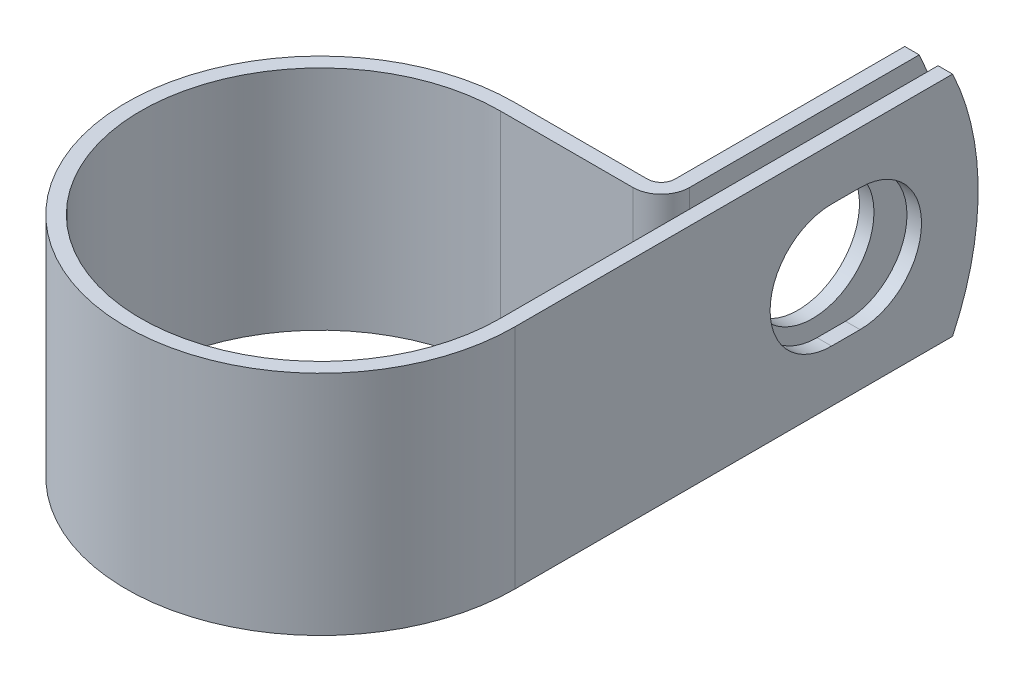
from build123d import *

# Parameters (mm, degrees)
EXTRUDE_THIN1_DEPTH = 9.525
SKETCH2_R           = 5.1562
CUT_EXTRUDE1_DEPTH  = 1.2192
CUT_EXTRUDE2_REACH  = 53.604
CUT_EXTRUDE3_DEPTH  = 50.168193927


with BuildPart() as part:
    # Sketch1 → Extrude-Thin1 (new, symmetric)
    with BuildSketch(Plane(origin=(0, 0, 0), x_dir=(1, 0, 0), z_dir=(0, 1, 0))):
        with BuildLine():
            Line((15.0749, 38.862), (15.0749, 15.0749))
            Line((15.0749, 15.0749), (15.0749, 0))
            ThreePointArc((15.0749, 0), (-10.659564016, -10.659564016), (0, 15.0749))
            Line((0, 15.0749), (11.12266, 15.0749))
            ThreePointArc((11.12266, 15.0749), (12.803763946, 15.771236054), (13.5001, 17.45234))
            Line((13.5001, 17.45234), (13.5001, 38.862))
            Line((13.5001, 38.862), (12.2809, 38.862))
            Line((12.2809, 38.862), (12.2809, 17.45234))
            ThreePointArc((12.2809, 17.45234), (11.941659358, 16.633340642), (11.12266, 16.2941))
            Line((11.12266, 16.2941), (0, 16.2941))
            ThreePointArc((0, 16.2941), (-11.521668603, -11.521668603), (16.2941, 0))
            Line((16.2941, 0), (16.2941, 15.0749))
            Line((16.2941, 15.0749), (16.2941, 38.862))
            Line((16.2941, 38.862), (15.0749, 38.862))
        make_face()
    extrude(amount=EXTRUDE_THIN1_DEPTH, both=True)

    # Sketch2 → Cut-Extrude1 (cut)
    with BuildSketch(Plane.ZY.offset(-12.2809)):
        with Locations((-27.7622, 0)):
            Circle(SKETCH2_R)
    extrude(amount=-CUT_EXTRUDE1_DEPTH, mode=Mode.SUBTRACT)

    # Sketch3 → Cut-Extrude2 (cut, up to next)
    with BuildSketch(Plane(origin=(16.2941, 0, 0), x_dir=(0, 0, -1), z_dir=(1, 0, 0)), mode=Mode.PRIVATE) as cut_extrude2_sk1:
        with BuildLine():
            Line((26.5684, 5.1562), (28.956, 5.1562))
            ThreePointArc((28.956, 5.1562), (34.1122, 0), (28.956, -5.1562))
            Line((28.956, -5.1562), (26.5684, -5.1562))
            ThreePointArc((26.5684, -5.1562), (21.4122, 0), (26.5684, 5.1562))
        make_face()
    cut_extrude2_tool1 = extrude(cut_extrude2_sk1.sketch, amount=-CUT_EXTRUDE2_REACH, mode=Mode.PRIVATE) & part.part
    add(cut_extrude2_tool1.solids().sort_by_distance((16.2941, 0, -27.7622))[0], mode=Mode.SUBTRACT)

    # Sketch4 → Cut-Extrude3 (cut, through all)
    with BuildSketch(Plane.ZY.offset(-12.2809)):
        with BuildLine():
            Line((-36.717463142, 9.525), (-38.862, 9.525))
            Line((-38.862, 9.525), (-38.862, -2e-09))
            ThreePointArc((-38.862, -2e-09), (-38.319238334, 4.881717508), (-36.717463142, 9.525))
        make_face()
        with BuildLine():
            ThreePointArc((-36.717463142, -9.525), (-38.319238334, -4.88171751), (-38.862, -2e-09))
            Line((-38.862, -2e-09), (-38.862, -9.525))
            Line((-38.862, -9.525), (-36.717463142, -9.525))
        make_face()
    extrude(amount=-CUT_EXTRUDE3_DEPTH, mode=Mode.SUBTRACT)


solid = part.part
